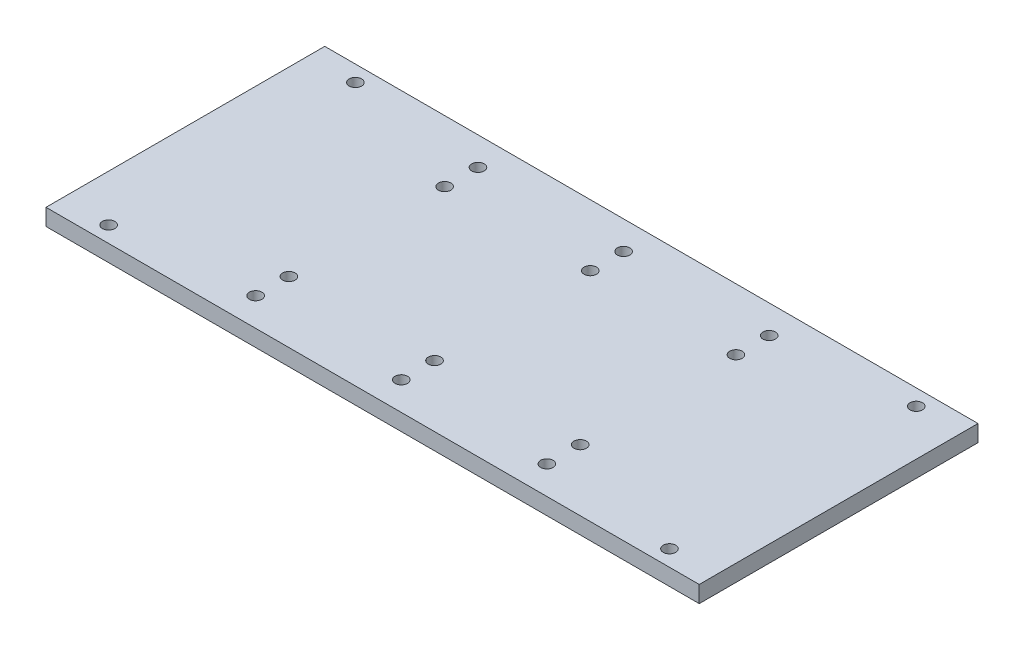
ISO-10303-21;
HEADER;
FILE_DESCRIPTION(('STEP AP214'),'2;1');
FILE_NAME('part.step','',(''),(''),'','','');
FILE_SCHEMA(('AUTOMOTIVE_DESIGN { 1 0 10303 214 1 1 1 1 }'));
ENDSEC;
DATA;
#1=APPLICATION_CONTEXT('core data for automotive mechanical design processes');
#2=APPLICATION_PROTOCOL_DEFINITION('international standard','automotive_design',2000,#1);
#3=PRODUCT_CONTEXT('',#1,'mechanical');
#4=PRODUCT('Part','Part','',(#3));
#5=PRODUCT_RELATED_PRODUCT_CATEGORY('part','',(#4));
#6=PRODUCT_DEFINITION_FORMATION('','',#4);
#7=PRODUCT_DEFINITION_CONTEXT('part definition',#1,'design');
#8=PRODUCT_DEFINITION('design','',#6,#7);
#9=PRODUCT_DEFINITION_SHAPE('','',#8);
#10=(LENGTH_UNIT() NAMED_UNIT(*) SI_UNIT(.MILLI.,.METRE.));
#11=(NAMED_UNIT(*) PLANE_ANGLE_UNIT() SI_UNIT($,.RADIAN.));
#12=(NAMED_UNIT(*) SI_UNIT($,.STERADIAN.) SOLID_ANGLE_UNIT());
#13=UNCERTAINTY_MEASURE_WITH_UNIT(LENGTH_MEASURE(1.E-05),#10,'distance_accuracy_value','');
#14=(GEOMETRIC_REPRESENTATION_CONTEXT(3) GLOBAL_UNCERTAINTY_ASSIGNED_CONTEXT((#13)) GLOBAL_UNIT_ASSIGNED_CONTEXT((#10,
#11,#12)) REPRESENTATION_CONTEXT('',''));
#15=CARTESIAN_POINT('',(0.,0.,0.));
#16=DIRECTION('',(0.,0.,1.));
#17=DIRECTION('',(1.,0.,0.));
#18=AXIS2_PLACEMENT_3D('',#15,#16,#17);
#19=CARTESIAN_POINT('',(78.5,4.,33.5));
#20=DIRECTION('',(-1.,0.,0.));
#21=DIRECTION('',(0.,0.,1.));
#22=AXIS2_PLACEMENT_3D('',#19,#20,#21);
#23=PLANE('',#22);
#24=DIRECTION('',(0.,0.,-1.));
#25=VECTOR('',#24,1.);
#26=CARTESIAN_POINT('',(78.5,0.,33.5));
#27=LINE('',#26,#25);
#28=CARTESIAN_POINT('',(78.5,0.,33.5));
#29=VERTEX_POINT('',#28);
#30=CARTESIAN_POINT('',(78.5,0.,-33.5));
#31=VERTEX_POINT('',#30);
#32=EDGE_CURVE('E100',#29,#31,#27,.T.);
#33=ORIENTED_EDGE('',*,*,#32,.T.);
#34=DIRECTION('',(0.,-1.,0.));
#35=VECTOR('',#34,1.);
#36=CARTESIAN_POINT('',(78.5,4.,-33.5));
#37=LINE('',#36,#35);
#38=CARTESIAN_POINT('',(78.5,4.,-33.5));
#39=VERTEX_POINT('',#38);
#40=EDGE_CURVE('E11',#39,#31,#37,.T.);
#41=ORIENTED_EDGE('',*,*,#40,.F.);
#42=DIRECTION('',(0.,0.,-1.));
#43=VECTOR('',#42,1.);
#44=CARTESIAN_POINT('',(78.5,4.,33.5));
#45=LINE('',#44,#43);
#46=CARTESIAN_POINT('',(78.5,4.,33.5));
#47=VERTEX_POINT('',#46);
#48=EDGE_CURVE('E87',#47,#39,#45,.T.);
#49=ORIENTED_EDGE('',*,*,#48,.F.);
#50=DIRECTION('',(0.,-1.,0.));
#51=VECTOR('',#50,1.);
#52=CARTESIAN_POINT('',(78.5,4.,33.5));
#53=LINE('',#52,#51);
#54=EDGE_CURVE('E96',#47,#29,#53,.T.);
#55=ORIENTED_EDGE('',*,*,#54,.T.);
#56=EDGE_LOOP('',(#33,#41,#49,#55));
#57=FACE_BOUND('',#56,.T.);
#58=ADVANCED_FACE('F34',(#57),#23,.F.);
#59=CARTESIAN_POINT('',(-78.5,4.,-33.5));
#60=DIRECTION('',(0.,0.,1.));
#61=DIRECTION('',(1.,0.,0.));
#62=AXIS2_PLACEMENT_3D('',#59,#60,#61);
#63=PLANE('',#62);
#64=DIRECTION('',(-1.,0.,0.));
#65=VECTOR('',#64,1.);
#66=CARTESIAN_POINT('',(-78.5,0.,-33.5));
#67=LINE('',#66,#65);
#68=CARTESIAN_POINT('',(-78.5,0.,-33.5));
#69=VERTEX_POINT('',#68);
#70=EDGE_CURVE('E91',#31,#69,#67,.T.);
#71=ORIENTED_EDGE('',*,*,#70,.T.);
#72=DIRECTION('',(0.,-1.,0.));
#73=VECTOR('',#72,1.);
#74=CARTESIAN_POINT('',(-78.5,4.,-33.5));
#75=LINE('',#74,#73);
#76=CARTESIAN_POINT('',(-78.5,4.,-33.5));
#77=VERTEX_POINT('',#76);
#78=EDGE_CURVE('E43',#77,#69,#75,.T.);
#79=ORIENTED_EDGE('',*,*,#78,.F.);
#80=DIRECTION('',(-1.,0.,0.));
#81=VECTOR('',#80,1.);
#82=CARTESIAN_POINT('',(-78.5,4.,-33.5));
#83=LINE('',#82,#81);
#84=EDGE_CURVE('E82',#39,#77,#83,.T.);
#85=ORIENTED_EDGE('',*,*,#84,.F.);
#86=ORIENTED_EDGE('',*,*,#40,.T.);
#87=EDGE_LOOP('',(#71,#79,#85,#86));
#88=FACE_BOUND('',#87,.T.);
#89=ADVANCED_FACE('F90',(#88),#63,.F.);
#90=CARTESIAN_POINT('',(-78.5,4.,33.5));
#91=DIRECTION('',(1.,0.,0.));
#92=DIRECTION('',(0.,0.,-1.));
#93=AXIS2_PLACEMENT_3D('',#90,#91,#92);
#94=PLANE('',#93);
#95=DIRECTION('',(0.,0.,1.));
#96=VECTOR('',#95,1.);
#97=CARTESIAN_POINT('',(-78.5,0.,33.5));
#98=LINE('',#97,#96);
#99=CARTESIAN_POINT('',(-78.5,0.,33.5));
#100=VERTEX_POINT('',#99);
#101=EDGE_CURVE('E69',#69,#100,#98,.T.);
#102=ORIENTED_EDGE('',*,*,#101,.T.);
#103=DIRECTION('',(0.,-1.,0.));
#104=VECTOR('',#103,1.);
#105=CARTESIAN_POINT('',(-78.5,4.,33.5));
#106=LINE('',#105,#104);
#107=CARTESIAN_POINT('',(-78.5,4.,33.5));
#108=VERTEX_POINT('',#107);
#109=EDGE_CURVE('E92',#108,#100,#106,.T.);
#110=ORIENTED_EDGE('',*,*,#109,.F.);
#111=DIRECTION('',(0.,0.,1.));
#112=VECTOR('',#111,1.);
#113=CARTESIAN_POINT('',(-78.5,4.,33.5));
#114=LINE('',#113,#112);
#115=EDGE_CURVE('E85',#77,#108,#114,.T.);
#116=ORIENTED_EDGE('',*,*,#115,.F.);
#117=ORIENTED_EDGE('',*,*,#78,.T.);
#118=EDGE_LOOP('',(#102,#110,#116,#117));
#119=FACE_BOUND('',#118,.T.);
#120=ADVANCED_FACE('F94',(#119),#94,.F.);
#121=CARTESIAN_POINT('',(-78.5,4.,33.5));
#122=DIRECTION('',(0.,0.,-1.));
#123=DIRECTION('',(-1.,0.,0.));
#124=AXIS2_PLACEMENT_3D('',#121,#122,#123);
#125=PLANE('',#124);
#126=DIRECTION('',(1.,0.,0.));
#127=VECTOR('',#126,1.);
#128=CARTESIAN_POINT('',(-78.5,0.,33.5));
#129=LINE('',#128,#127);
#130=EDGE_CURVE('E75',#100,#29,#129,.T.);
#131=ORIENTED_EDGE('',*,*,#130,.T.);
#132=ORIENTED_EDGE('',*,*,#54,.F.);
#133=DIRECTION('',(1.,0.,0.));
#134=VECTOR('',#133,1.);
#135=CARTESIAN_POINT('',(-78.5,4.,33.5));
#136=LINE('',#135,#134);
#137=EDGE_CURVE('E52',#108,#47,#136,.T.);
#138=ORIENTED_EDGE('',*,*,#137,.F.);
#139=ORIENTED_EDGE('',*,*,#109,.T.);
#140=EDGE_LOOP('',(#131,#132,#138,#139));
#141=FACE_BOUND('',#140,.T.);
#142=ADVANCED_FACE('F222',(#141),#125,.F.);
#143=CARTESIAN_POINT('',(0.,4.,0.));
#144=DIRECTION('',(0.,-1.,0.));
#145=DIRECTION('',(0.,0.,-1.));
#146=AXIS2_PLACEMENT_3D('',#143,#144,#145);
#147=PLANE('',#146);
#148=CARTESIAN_POINT('',(0.10111855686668,4.,-18.7153903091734));
#149=DIRECTION('',(0.,1.,0.));
#150=DIRECTION('',(0.,0.,1.));
#151=AXIS2_PLACEMENT_3D('',#148,#149,#150);
#152=CIRCLE('',#151,1.5);
#153=CARTESIAN_POINT('',(0.10111855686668,4.,-17.2153903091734));
#154=VERTEX_POINT('',#153);
#155=EDGE_CURVE('E147',#154,#154,#152,.T.);
#156=ORIENTED_EDGE('',*,*,#155,.F.);
#157=EDGE_LOOP('',(#156));
#158=FACE_BOUND('',#157,.T.);
#159=CARTESIAN_POINT('',(-34.8988814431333,4.,-18.7153903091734));
#160=DIRECTION('',(0.,1.,0.));
#161=DIRECTION('',(0.,0.,1.));
#162=AXIS2_PLACEMENT_3D('',#159,#160,#161);
#163=CIRCLE('',#162,1.5);
#164=CARTESIAN_POINT('',(-34.8988814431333,4.,-17.2153903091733));
#165=VERTEX_POINT('',#164);
#166=EDGE_CURVE('E410',#165,#165,#163,.T.);
#167=ORIENTED_EDGE('',*,*,#166,.F.);
#168=EDGE_LOOP('',(#167));
#169=FACE_BOUND('',#168,.T.);
#170=CARTESIAN_POINT('',(35.1011185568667,4.,-26.7153903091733));
#171=DIRECTION('',(0.,1.,0.));
#172=DIRECTION('',(0.,0.,1.));
#173=AXIS2_PLACEMENT_3D('',#170,#171,#172);
#174=CIRCLE('',#173,1.5);
#175=CARTESIAN_POINT('',(35.1011185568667,4.,-25.2153903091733));
#176=VERTEX_POINT('',#175);
#177=EDGE_CURVE('E413',#176,#176,#174,.T.);
#178=ORIENTED_EDGE('',*,*,#177,.F.);
#179=EDGE_LOOP('',(#178));
#180=FACE_BOUND('',#179,.T.);
#181=CARTESIAN_POINT('',(0.101118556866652,4.,-26.7153903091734));
#182=DIRECTION('',(0.,1.,0.));
#183=DIRECTION('',(0.,0.,1.));
#184=AXIS2_PLACEMENT_3D('',#181,#182,#183);
#185=CIRCLE('',#184,1.5);
#186=CARTESIAN_POINT('',(0.101118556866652,4.,-25.2153903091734));
#187=VERTEX_POINT('',#186);
#188=EDGE_CURVE('E417',#187,#187,#185,.T.);
#189=ORIENTED_EDGE('',*,*,#188,.F.);
#190=EDGE_LOOP('',(#189));
#191=FACE_BOUND('',#190,.T.);
#192=CARTESIAN_POINT('',(-34.8988814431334,4.,-26.7153903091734));
#193=DIRECTION('',(0.,1.,0.));
#194=DIRECTION('',(0.,0.,1.));
#195=AXIS2_PLACEMENT_3D('',#192,#193,#194);
#196=CIRCLE('',#195,1.5);
#197=CARTESIAN_POINT('',(-34.8988814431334,4.,-25.2153903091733));
#198=VERTEX_POINT('',#197);
#199=EDGE_CURVE('E165',#198,#198,#196,.T.);
#200=ORIENTED_EDGE('',*,*,#199,.F.);
#201=EDGE_LOOP('',(#200));
#202=FACE_BOUND('',#201,.T.);
#203=CARTESIAN_POINT('',(35.1011185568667,4.,-18.7153903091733));
#204=DIRECTION('',(0.,1.,0.));
#205=DIRECTION('',(0.,0.,1.));
#206=AXIS2_PLACEMENT_3D('',#203,#204,#205);
#207=CIRCLE('',#206,1.5);
#208=CARTESIAN_POINT('',(35.1011185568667,4.,-17.2153903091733));
#209=VERTEX_POINT('',#208);
#210=EDGE_CURVE('E142',#209,#209,#207,.T.);
#211=ORIENTED_EDGE('',*,*,#210,.F.);
#212=EDGE_LOOP('',(#211));
#213=FACE_BOUND('',#212,.T.);
#214=CARTESIAN_POINT('',(0.101118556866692,3.99999999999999,18.7153903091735));
#215=DIRECTION('',(0.,1.,0.));
#216=DIRECTION('',(0.,0.,1.));
#217=AXIS2_PLACEMENT_3D('',#214,#215,#216);
#218=CIRCLE('',#217,1.5);
#219=CARTESIAN_POINT('',(0.101118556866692,3.99999999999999,20.2153903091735));
#220=VERTEX_POINT('',#219);
#221=EDGE_CURVE('E126',#220,#220,#218,.T.);
#222=ORIENTED_EDGE('',*,*,#221,.F.);
#223=EDGE_LOOP('',(#222));
#224=FACE_BOUND('',#223,.T.);
#225=CARTESIAN_POINT('',(35.1011185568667,3.99999999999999,18.7153903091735));
#226=DIRECTION('',(0.,1.,0.));
#227=DIRECTION('',(0.,0.,1.));
#228=AXIS2_PLACEMENT_3D('',#225,#226,#227);
#229=CIRCLE('',#228,1.5);
#230=CARTESIAN_POINT('',(35.1011185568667,3.99999999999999,20.2153903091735));
#231=VERTEX_POINT('',#230);
#232=EDGE_CURVE('E169',#231,#231,#229,.T.);
#233=ORIENTED_EDGE('',*,*,#232,.F.);
#234=EDGE_LOOP('',(#233));
#235=FACE_BOUND('',#234,.T.);
#236=CARTESIAN_POINT('',(-34.8988814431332,3.99999999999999,26.7153903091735));
#237=DIRECTION('',(0.,1.,0.));
#238=DIRECTION('',(0.,0.,1.));
#239=AXIS2_PLACEMENT_3D('',#236,#237,#238);
#240=CIRCLE('',#239,1.5);
#241=CARTESIAN_POINT('',(-34.8988814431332,3.99999999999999,28.2153903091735));
#242=VERTEX_POINT('',#241);
#243=EDGE_CURVE('E172',#242,#242,#240,.T.);
#244=ORIENTED_EDGE('',*,*,#243,.F.);
#245=EDGE_LOOP('',(#244));
#246=FACE_BOUND('',#245,.T.);
#247=CARTESIAN_POINT('',(0.101118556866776,3.99999999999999,26.7153903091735));
#248=DIRECTION('',(0.,1.,0.));
#249=DIRECTION('',(0.,0.,1.));
#250=AXIS2_PLACEMENT_3D('',#247,#248,#249);
#251=CIRCLE('',#250,1.5);
#252=CARTESIAN_POINT('',(0.101118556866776,3.99999999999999,28.2153903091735));
#253=VERTEX_POINT('',#252);
#254=EDGE_CURVE('E175',#253,#253,#251,.T.);
#255=ORIENTED_EDGE('',*,*,#254,.F.);
#256=EDGE_LOOP('',(#255));
#257=FACE_BOUND('',#256,.T.);
#258=CARTESIAN_POINT('',(35.1011185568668,3.99999999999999,26.7153903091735));
#259=DIRECTION('',(0.,1.,0.));
#260=DIRECTION('',(0.,0.,1.));
#261=AXIS2_PLACEMENT_3D('',#258,#259,#260);
#262=CIRCLE('',#261,1.5);
#263=CARTESIAN_POINT('',(35.1011185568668,3.99999999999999,28.2153903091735));
#264=VERTEX_POINT('',#263);
#265=EDGE_CURVE('E141',#264,#264,#262,.T.);
#266=ORIENTED_EDGE('',*,*,#265,.F.);
#267=EDGE_LOOP('',(#266));
#268=FACE_BOUND('',#267,.T.);
#269=CARTESIAN_POINT('',(-34.8988814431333,3.99999999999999,18.7153903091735));
#270=DIRECTION('',(0.,1.,0.));
#271=DIRECTION('',(0.,0.,1.));
#272=AXIS2_PLACEMENT_3D('',#269,#270,#271);
#273=CIRCLE('',#272,1.5);
#274=CARTESIAN_POINT('',(-34.8988814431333,3.99999999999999,20.2153903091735));
#275=VERTEX_POINT('',#274);
#276=EDGE_CURVE('E121',#275,#275,#273,.T.);
#277=ORIENTED_EDGE('',*,*,#276,.F.);
#278=EDGE_LOOP('',(#277));
#279=FACE_BOUND('',#278,.T.);
#280=CARTESIAN_POINT('',(-67.2977628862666,4.,29.6576766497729));
#281=DIRECTION('',(0.,-1.,0.));
#282=DIRECTION('',(0.,0.,-1.));
#283=AXIS2_PLACEMENT_3D('',#280,#281,#282);
#284=CIRCLE('',#283,1.50000000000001);
#285=CARTESIAN_POINT('',(-67.2977628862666,4.,28.1576766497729));
#286=VERTEX_POINT('',#285);
#287=EDGE_CURVE('E184',#286,#286,#284,.T.);
#288=ORIENTED_EDGE('',*,*,#287,.T.);
#289=EDGE_LOOP('',(#288));
#290=FACE_BOUND('',#289,.T.);
#291=CARTESIAN_POINT('',(67.5,4.,29.657676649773));
#292=DIRECTION('',(0.,-1.,0.));
#293=DIRECTION('',(0.,0.,-1.));
#294=AXIS2_PLACEMENT_3D('',#291,#292,#293);
#295=CIRCLE('',#294,1.49999999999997);
#296=CARTESIAN_POINT('',(67.5,4.,28.157676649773));
#297=VERTEX_POINT('',#296);
#298=EDGE_CURVE('E116',#297,#297,#295,.T.);
#299=ORIENTED_EDGE('',*,*,#298,.T.);
#300=EDGE_LOOP('',(#299));
#301=FACE_BOUND('',#300,.T.);
#302=CARTESIAN_POINT('',(-67.2977628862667,4.,-29.6576766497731));
#303=DIRECTION('',(0.,-1.,0.));
#304=DIRECTION('',(0.,0.,-1.));
#305=AXIS2_PLACEMENT_3D('',#302,#303,#304);
#306=CIRCLE('',#305,1.5);
#307=CARTESIAN_POINT('',(-67.2977628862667,4.,-31.1576766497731));
#308=VERTEX_POINT('',#307);
#309=EDGE_CURVE('E112',#308,#308,#306,.T.);
#310=ORIENTED_EDGE('',*,*,#309,.T.);
#311=EDGE_LOOP('',(#310));
#312=FACE_BOUND('',#311,.T.);
#313=CARTESIAN_POINT('',(67.5,4.,-29.6576766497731));
#314=DIRECTION('',(0.,-1.,0.));
#315=DIRECTION('',(0.,0.,-1.));
#316=AXIS2_PLACEMENT_3D('',#313,#314,#315);
#317=CIRCLE('',#316,1.5);
#318=CARTESIAN_POINT('',(67.5,4.,-31.1576766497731));
#319=VERTEX_POINT('',#318);
#320=EDGE_CURVE('E103',#319,#319,#317,.T.);
#321=ORIENTED_EDGE('',*,*,#320,.T.);
#322=EDGE_LOOP('',(#321));
#323=FACE_BOUND('',#322,.T.);
#324=ORIENTED_EDGE('',*,*,#48,.T.);
#325=ORIENTED_EDGE('',*,*,#84,.T.);
#326=ORIENTED_EDGE('',*,*,#115,.T.);
#327=ORIENTED_EDGE('',*,*,#137,.T.);
#328=EDGE_LOOP('',(#324,#325,#326,#327));
#329=FACE_BOUND('',#328,.T.);
#330=ADVANCED_FACE('F83',(#158,#169,#180,#191,#202,#213,#224,#235,#246,#257,#268,#279,#290,#301,
#312,#323,#329),#147,.F.);
#331=CARTESIAN_POINT('',(0.,0.,0.));
#332=DIRECTION('',(0.,-1.,0.));
#333=DIRECTION('',(0.,0.,-1.));
#334=AXIS2_PLACEMENT_3D('',#331,#332,#333);
#335=PLANE('',#334);
#336=CARTESIAN_POINT('',(0.10111855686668,0.,-18.7153903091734));
#337=DIRECTION('',(0.,-1.,0.));
#338=DIRECTION('',(0.,0.,-1.));
#339=AXIS2_PLACEMENT_3D('',#336,#337,#338);
#340=CIRCLE('',#339,1.5);
#341=CARTESIAN_POINT('',(0.10111855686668,0.,-20.2153903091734));
#342=VERTEX_POINT('',#341);
#343=EDGE_CURVE('E37',#342,#342,#340,.T.);
#344=ORIENTED_EDGE('',*,*,#343,.F.);
#345=EDGE_LOOP('',(#344));
#346=FACE_BOUND('',#345,.T.);
#347=CARTESIAN_POINT('',(-34.8988814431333,0.,-18.7153903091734));
#348=DIRECTION('',(0.,-1.,0.));
#349=DIRECTION('',(0.,0.,-1.));
#350=AXIS2_PLACEMENT_3D('',#347,#348,#349);
#351=CIRCLE('',#350,1.5);
#352=CARTESIAN_POINT('',(-34.8988814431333,0.,-20.2153903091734));
#353=VERTEX_POINT('',#352);
#354=EDGE_CURVE('E152',#353,#353,#351,.T.);
#355=ORIENTED_EDGE('',*,*,#354,.F.);
#356=EDGE_LOOP('',(#355));
#357=FACE_BOUND('',#356,.T.);
#358=CARTESIAN_POINT('',(35.1011185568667,0.,-26.7153903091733));
#359=DIRECTION('',(0.,-1.,0.));
#360=DIRECTION('',(0.,0.,-1.));
#361=AXIS2_PLACEMENT_3D('',#358,#359,#360);
#362=CIRCLE('',#361,1.5);
#363=CARTESIAN_POINT('',(35.1011185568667,0.,-28.2153903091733));
#364=VERTEX_POINT('',#363);
#365=EDGE_CURVE('E150',#364,#364,#362,.T.);
#366=ORIENTED_EDGE('',*,*,#365,.F.);
#367=EDGE_LOOP('',(#366));
#368=FACE_BOUND('',#367,.T.);
#369=CARTESIAN_POINT('',(0.101118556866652,0.,-26.7153903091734));
#370=DIRECTION('',(0.,-1.,0.));
#371=DIRECTION('',(0.,0.,-1.));
#372=AXIS2_PLACEMENT_3D('',#369,#370,#371);
#373=CIRCLE('',#372,1.5);
#374=CARTESIAN_POINT('',(0.101118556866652,0.,-28.2153903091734));
#375=VERTEX_POINT('',#374);
#376=EDGE_CURVE('E146',#375,#375,#373,.T.);
#377=ORIENTED_EDGE('',*,*,#376,.F.);
#378=EDGE_LOOP('',(#377));
#379=FACE_BOUND('',#378,.T.);
#380=CARTESIAN_POINT('',(-34.8988814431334,0.,-26.7153903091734));
#381=DIRECTION('',(0.,-1.,0.));
#382=DIRECTION('',(0.,0.,-1.));
#383=AXIS2_PLACEMENT_3D('',#380,#381,#382);
#384=CIRCLE('',#383,1.5);
#385=CARTESIAN_POINT('',(-34.8988814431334,0.,-28.2153903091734));
#386=VERTEX_POINT('',#385);
#387=EDGE_CURVE('E143',#386,#386,#384,.T.);
#388=ORIENTED_EDGE('',*,*,#387,.F.);
#389=EDGE_LOOP('',(#388));
#390=FACE_BOUND('',#389,.T.);
#391=CARTESIAN_POINT('',(35.1011185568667,0.,-18.7153903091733));
#392=DIRECTION('',(0.,-1.,0.));
#393=DIRECTION('',(0.,0.,-1.));
#394=AXIS2_PLACEMENT_3D('',#391,#392,#393);
#395=CIRCLE('',#394,1.5);
#396=CARTESIAN_POINT('',(35.1011185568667,0.,-20.2153903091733));
#397=VERTEX_POINT('',#396);
#398=EDGE_CURVE('E138',#397,#397,#395,.T.);
#399=ORIENTED_EDGE('',*,*,#398,.F.);
#400=EDGE_LOOP('',(#399));
#401=FACE_BOUND('',#400,.T.);
#402=CARTESIAN_POINT('',(0.101118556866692,0.,18.7153903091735));
#403=DIRECTION('',(0.,-1.,0.));
#404=DIRECTION('',(0.,0.,-1.));
#405=AXIS2_PLACEMENT_3D('',#402,#403,#404);
#406=CIRCLE('',#405,1.5);
#407=CARTESIAN_POINT('',(0.101118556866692,0.,17.2153903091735));
#408=VERTEX_POINT('',#407);
#409=EDGE_CURVE('E135',#408,#408,#406,.T.);
#410=ORIENTED_EDGE('',*,*,#409,.F.);
#411=EDGE_LOOP('',(#410));
#412=FACE_BOUND('',#411,.T.);
#413=CARTESIAN_POINT('',(35.1011185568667,0.,18.7153903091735));
#414=DIRECTION('',(0.,-1.,0.));
#415=DIRECTION('',(0.,0.,-1.));
#416=AXIS2_PLACEMENT_3D('',#413,#414,#415);
#417=CIRCLE('',#416,1.5);
#418=CARTESIAN_POINT('',(35.1011185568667,0.,17.2153903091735));
#419=VERTEX_POINT('',#418);
#420=EDGE_CURVE('E132',#419,#419,#417,.T.);
#421=ORIENTED_EDGE('',*,*,#420,.F.);
#422=EDGE_LOOP('',(#421));
#423=FACE_BOUND('',#422,.T.);
#424=CARTESIAN_POINT('',(-34.8988814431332,0.,26.7153903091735));
#425=DIRECTION('',(0.,-1.,0.));
#426=DIRECTION('',(0.,0.,-1.));
#427=AXIS2_PLACEMENT_3D('',#424,#425,#426);
#428=CIRCLE('',#427,1.5);
#429=CARTESIAN_POINT('',(-34.8988814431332,0.,25.2153903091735));
#430=VERTEX_POINT('',#429);
#431=EDGE_CURVE('E129',#430,#430,#428,.T.);
#432=ORIENTED_EDGE('',*,*,#431,.F.);
#433=EDGE_LOOP('',(#432));
#434=FACE_BOUND('',#433,.T.);
#435=CARTESIAN_POINT('',(0.101118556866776,0.,26.7153903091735));
#436=DIRECTION('',(0.,-1.,0.));
#437=DIRECTION('',(0.,0.,-1.));
#438=AXIS2_PLACEMENT_3D('',#435,#436,#437);
#439=CIRCLE('',#438,1.5);
#440=CARTESIAN_POINT('',(0.101118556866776,0.,25.2153903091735));
#441=VERTEX_POINT('',#440);
#442=EDGE_CURVE('E125',#441,#441,#439,.T.);
#443=ORIENTED_EDGE('',*,*,#442,.F.);
#444=EDGE_LOOP('',(#443));
#445=FACE_BOUND('',#444,.T.);
#446=CARTESIAN_POINT('',(35.1011185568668,0.,26.7153903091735));
#447=DIRECTION('',(0.,-1.,0.));
#448=DIRECTION('',(0.,0.,-1.));
#449=AXIS2_PLACEMENT_3D('',#446,#447,#448);
#450=CIRCLE('',#449,1.5);
#451=CARTESIAN_POINT('',(35.1011185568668,0.,25.2153903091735));
#452=VERTEX_POINT('',#451);
#453=EDGE_CURVE('E122',#452,#452,#450,.T.);
#454=ORIENTED_EDGE('',*,*,#453,.F.);
#455=EDGE_LOOP('',(#454));
#456=FACE_BOUND('',#455,.T.);
#457=CARTESIAN_POINT('',(-34.8988814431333,0.,18.7153903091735));
#458=DIRECTION('',(0.,-1.,0.));
#459=DIRECTION('',(0.,0.,-1.));
#460=AXIS2_PLACEMENT_3D('',#457,#458,#459);
#461=CIRCLE('',#460,1.5);
#462=CARTESIAN_POINT('',(-34.8988814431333,0.,17.2153903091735));
#463=VERTEX_POINT('',#462);
#464=EDGE_CURVE('E117',#463,#463,#461,.T.);
#465=ORIENTED_EDGE('',*,*,#464,.F.);
#466=EDGE_LOOP('',(#465));
#467=FACE_BOUND('',#466,.T.);
#468=CARTESIAN_POINT('',(-67.2977628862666,0.,29.6576766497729));
#469=DIRECTION('',(0.,-1.,0.));
#470=DIRECTION('',(0.,0.,-1.));
#471=AXIS2_PLACEMENT_3D('',#468,#469,#470);
#472=CIRCLE('',#471,1.50000000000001);
#473=CARTESIAN_POINT('',(-67.2977628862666,0.,28.1576766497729));
#474=VERTEX_POINT('',#473);
#475=EDGE_CURVE('E120',#474,#474,#472,.T.);
#476=ORIENTED_EDGE('',*,*,#475,.F.);
#477=EDGE_LOOP('',(#476));
#478=FACE_BOUND('',#477,.T.);
#479=CARTESIAN_POINT('',(67.5,0.,29.657676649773));
#480=DIRECTION('',(0.,-1.,0.));
#481=DIRECTION('',(0.,0.,-1.));
#482=AXIS2_PLACEMENT_3D('',#479,#480,#481);
#483=CIRCLE('',#482,1.49999999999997);
#484=CARTESIAN_POINT('',(67.5,0.,28.157676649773));
#485=VERTEX_POINT('',#484);
#486=EDGE_CURVE('E187',#485,#485,#483,.T.);
#487=ORIENTED_EDGE('',*,*,#486,.F.);
#488=EDGE_LOOP('',(#487));
#489=FACE_BOUND('',#488,.T.);
#490=CARTESIAN_POINT('',(-67.2977628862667,0.,-29.6576766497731));
#491=DIRECTION('',(0.,-1.,0.));
#492=DIRECTION('',(0.,0.,-1.));
#493=AXIS2_PLACEMENT_3D('',#490,#491,#492);
#494=CIRCLE('',#493,1.5);
#495=CARTESIAN_POINT('',(-67.2977628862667,0.,-31.1576766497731));
#496=VERTEX_POINT('',#495);
#497=EDGE_CURVE('E113',#496,#496,#494,.T.);
#498=ORIENTED_EDGE('',*,*,#497,.F.);
#499=EDGE_LOOP('',(#498));
#500=FACE_BOUND('',#499,.T.);
#501=CARTESIAN_POINT('',(67.5,0.,-29.6576766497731));
#502=DIRECTION('',(0.,-1.,0.));
#503=DIRECTION('',(0.,0.,-1.));
#504=AXIS2_PLACEMENT_3D('',#501,#502,#503);
#505=CIRCLE('',#504,1.5);
#506=CARTESIAN_POINT('',(67.5,0.,-31.1576766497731));
#507=VERTEX_POINT('',#506);
#508=EDGE_CURVE('E109',#507,#507,#505,.T.);
#509=ORIENTED_EDGE('',*,*,#508,.F.);
#510=EDGE_LOOP('',(#509));
#511=FACE_BOUND('',#510,.T.);
#512=ORIENTED_EDGE('',*,*,#32,.F.);
#513=ORIENTED_EDGE('',*,*,#130,.F.);
#514=ORIENTED_EDGE('',*,*,#101,.F.);
#515=ORIENTED_EDGE('',*,*,#70,.F.);
#516=EDGE_LOOP('',(#512,#513,#514,#515));
#517=FACE_BOUND('',#516,.T.);
#518=ADVANCED_FACE('F201',(#346,#357,#368,#379,#390,#401,#412,#423,#434,#445,#456,#467,#478,
#489,#500,#511,#517),#335,.T.);
#519=CARTESIAN_POINT('',(67.5,17.,-29.657676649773));
#520=DIRECTION('',(0.,-1.,0.));
#521=DIRECTION('',(0.,0.,-1.));
#522=AXIS2_PLACEMENT_3D('',#519,#520,#521);
#523=CYLINDRICAL_SURFACE('',#522,1.5);
#524=ORIENTED_EDGE('',*,*,#508,.T.);
#525=EDGE_LOOP('',(#524));
#526=FACE_BOUND('',#525,.T.);
#527=ORIENTED_EDGE('',*,*,#320,.F.);
#528=EDGE_LOOP('',(#527));
#529=FACE_BOUND('',#528,.T.);
#530=ADVANCED_FACE('F198',(#526,#529),#523,.F.);
#531=CARTESIAN_POINT('',(-67.2977628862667,17.,-29.657676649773));
#532=DIRECTION('',(0.,-1.,0.));
#533=DIRECTION('',(0.,0.,-1.));
#534=AXIS2_PLACEMENT_3D('',#531,#532,#533);
#535=CYLINDRICAL_SURFACE('',#534,1.5);
#536=ORIENTED_EDGE('',*,*,#497,.T.);
#537=EDGE_LOOP('',(#536));
#538=FACE_BOUND('',#537,.T.);
#539=ORIENTED_EDGE('',*,*,#309,.F.);
#540=EDGE_LOOP('',(#539));
#541=FACE_BOUND('',#540,.T.);
#542=ADVANCED_FACE('F200',(#538,#541),#535,.F.);
#543=CARTESIAN_POINT('',(67.5,20.,29.657676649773));
#544=DIRECTION('',(0.,-1.,0.));
#545=DIRECTION('',(0.,0.,-1.));
#546=AXIS2_PLACEMENT_3D('',#543,#544,#545);
#547=CYLINDRICAL_SURFACE('',#546,1.49999999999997);
#548=ORIENTED_EDGE('',*,*,#486,.T.);
#549=EDGE_LOOP('',(#548));
#550=FACE_BOUND('',#549,.T.);
#551=ORIENTED_EDGE('',*,*,#298,.F.);
#552=EDGE_LOOP('',(#551));
#553=FACE_BOUND('',#552,.T.);
#554=ADVANCED_FACE('F208',(#550,#553),#547,.F.);
#555=CARTESIAN_POINT('',(-67.2977628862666,20.,29.6576766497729));
#556=DIRECTION('',(0.,-1.,0.));
#557=DIRECTION('',(0.,0.,-1.));
#558=AXIS2_PLACEMENT_3D('',#555,#556,#557);
#559=CYLINDRICAL_SURFACE('',#558,1.50000000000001);
#560=ORIENTED_EDGE('',*,*,#475,.T.);
#561=EDGE_LOOP('',(#560));
#562=FACE_BOUND('',#561,.T.);
#563=ORIENTED_EDGE('',*,*,#287,.F.);
#564=EDGE_LOOP('',(#563));
#565=FACE_BOUND('',#564,.T.);
#566=ADVANCED_FACE('F275',(#562,#565),#559,.F.);
#567=CARTESIAN_POINT('',(-34.8988814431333,-16.,18.7153903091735));
#568=DIRECTION('',(0.,1.,0.));
#569=DIRECTION('',(0.,0.,1.));
#570=AXIS2_PLACEMENT_3D('',#567,#568,#569);
#571=CYLINDRICAL_SURFACE('',#570,1.5);
#572=ORIENTED_EDGE('',*,*,#464,.T.);
#573=EDGE_LOOP('',(#572));
#574=FACE_BOUND('',#573,.T.);
#575=ORIENTED_EDGE('',*,*,#276,.T.);
#576=EDGE_LOOP('',(#575));
#577=FACE_BOUND('',#576,.T.);
#578=ADVANCED_FACE('F284',(#574,#577),#571,.F.);
#579=CARTESIAN_POINT('',(35.1011185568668,-16.,26.7153903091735));
#580=DIRECTION('',(0.,1.,0.));
#581=DIRECTION('',(0.,0.,1.));
#582=AXIS2_PLACEMENT_3D('',#579,#580,#581);
#583=CYLINDRICAL_SURFACE('',#582,1.5);
#584=ORIENTED_EDGE('',*,*,#453,.T.);
#585=EDGE_LOOP('',(#584));
#586=FACE_BOUND('',#585,.T.);
#587=ORIENTED_EDGE('',*,*,#265,.T.);
#588=EDGE_LOOP('',(#587));
#589=FACE_BOUND('',#588,.T.);
#590=ADVANCED_FACE('F293',(#586,#589),#583,.F.);
#591=CARTESIAN_POINT('',(0.101118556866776,-16.,26.7153903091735));
#592=DIRECTION('',(0.,1.,0.));
#593=DIRECTION('',(0.,0.,1.));
#594=AXIS2_PLACEMENT_3D('',#591,#592,#593);
#595=CYLINDRICAL_SURFACE('',#594,1.5);
#596=ORIENTED_EDGE('',*,*,#442,.T.);
#597=EDGE_LOOP('',(#596));
#598=FACE_BOUND('',#597,.T.);
#599=ORIENTED_EDGE('',*,*,#254,.T.);
#600=EDGE_LOOP('',(#599));
#601=FACE_BOUND('',#600,.T.);
#602=ADVANCED_FACE('F302',(#598,#601),#595,.F.);
#603=CARTESIAN_POINT('',(-34.8988814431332,-16.,26.7153903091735));
#604=DIRECTION('',(0.,1.,0.));
#605=DIRECTION('',(0.,0.,1.));
#606=AXIS2_PLACEMENT_3D('',#603,#604,#605);
#607=CYLINDRICAL_SURFACE('',#606,1.5);
#608=ORIENTED_EDGE('',*,*,#431,.T.);
#609=EDGE_LOOP('',(#608));
#610=FACE_BOUND('',#609,.T.);
#611=ORIENTED_EDGE('',*,*,#243,.T.);
#612=EDGE_LOOP('',(#611));
#613=FACE_BOUND('',#612,.T.);
#614=ADVANCED_FACE('F311',(#610,#613),#607,.F.);
#615=CARTESIAN_POINT('',(35.1011185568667,-16.,18.7153903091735));
#616=DIRECTION('',(0.,1.,0.));
#617=DIRECTION('',(0.,0.,1.));
#618=AXIS2_PLACEMENT_3D('',#615,#616,#617);
#619=CYLINDRICAL_SURFACE('',#618,1.5);
#620=ORIENTED_EDGE('',*,*,#420,.T.);
#621=EDGE_LOOP('',(#620));
#622=FACE_BOUND('',#621,.T.);
#623=ORIENTED_EDGE('',*,*,#232,.T.);
#624=EDGE_LOOP('',(#623));
#625=FACE_BOUND('',#624,.T.);
#626=ADVANCED_FACE('F320',(#622,#625),#619,.F.);
#627=CARTESIAN_POINT('',(0.101118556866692,-16.,18.7153903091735));
#628=DIRECTION('',(0.,1.,0.));
#629=DIRECTION('',(0.,0.,1.));
#630=AXIS2_PLACEMENT_3D('',#627,#628,#629);
#631=CYLINDRICAL_SURFACE('',#630,1.5);
#632=ORIENTED_EDGE('',*,*,#409,.T.);
#633=EDGE_LOOP('',(#632));
#634=FACE_BOUND('',#633,.T.);
#635=ORIENTED_EDGE('',*,*,#221,.T.);
#636=EDGE_LOOP('',(#635));
#637=FACE_BOUND('',#636,.T.);
#638=ADVANCED_FACE('F329',(#634,#637),#631,.F.);
#639=CARTESIAN_POINT('',(35.1011185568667,-16.,-18.7153903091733));
#640=DIRECTION('',(0.,1.,0.));
#641=DIRECTION('',(0.,0.,1.));
#642=AXIS2_PLACEMENT_3D('',#639,#640,#641);
#643=CYLINDRICAL_SURFACE('',#642,1.5);
#644=ORIENTED_EDGE('',*,*,#398,.T.);
#645=EDGE_LOOP('',(#644));
#646=FACE_BOUND('',#645,.T.);
#647=ORIENTED_EDGE('',*,*,#210,.T.);
#648=EDGE_LOOP('',(#647));
#649=FACE_BOUND('',#648,.T.);
#650=ADVANCED_FACE('F338',(#646,#649),#643,.F.);
#651=CARTESIAN_POINT('',(-34.8988814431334,-16.,-26.7153903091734));
#652=DIRECTION('',(0.,1.,0.));
#653=DIRECTION('',(0.,0.,1.));
#654=AXIS2_PLACEMENT_3D('',#651,#652,#653);
#655=CYLINDRICAL_SURFACE('',#654,1.5);
#656=ORIENTED_EDGE('',*,*,#387,.T.);
#657=EDGE_LOOP('',(#656));
#658=FACE_BOUND('',#657,.T.);
#659=ORIENTED_EDGE('',*,*,#199,.T.);
#660=EDGE_LOOP('',(#659));
#661=FACE_BOUND('',#660,.T.);
#662=ADVANCED_FACE('F347',(#658,#661),#655,.F.);
#663=CARTESIAN_POINT('',(0.101118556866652,-16.,-26.7153903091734));
#664=DIRECTION('',(0.,1.,0.));
#665=DIRECTION('',(0.,0.,1.));
#666=AXIS2_PLACEMENT_3D('',#663,#664,#665);
#667=CYLINDRICAL_SURFACE('',#666,1.5);
#668=ORIENTED_EDGE('',*,*,#376,.T.);
#669=EDGE_LOOP('',(#668));
#670=FACE_BOUND('',#669,.T.);
#671=ORIENTED_EDGE('',*,*,#188,.T.);
#672=EDGE_LOOP('',(#671));
#673=FACE_BOUND('',#672,.T.);
#674=ADVANCED_FACE('F356',(#670,#673),#667,.F.);
#675=CARTESIAN_POINT('',(35.1011185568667,-16.,-26.7153903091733));
#676=DIRECTION('',(0.,1.,0.));
#677=DIRECTION('',(0.,0.,1.));
#678=AXIS2_PLACEMENT_3D('',#675,#676,#677);
#679=CYLINDRICAL_SURFACE('',#678,1.5);
#680=ORIENTED_EDGE('',*,*,#365,.T.);
#681=EDGE_LOOP('',(#680));
#682=FACE_BOUND('',#681,.T.);
#683=ORIENTED_EDGE('',*,*,#177,.T.);
#684=EDGE_LOOP('',(#683));
#685=FACE_BOUND('',#684,.T.);
#686=ADVANCED_FACE('F365',(#682,#685),#679,.F.);
#687=CARTESIAN_POINT('',(-34.8988814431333,-16.,-18.7153903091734));
#688=DIRECTION('',(0.,1.,0.));
#689=DIRECTION('',(0.,0.,1.));
#690=AXIS2_PLACEMENT_3D('',#687,#688,#689);
#691=CYLINDRICAL_SURFACE('',#690,1.5);
#692=ORIENTED_EDGE('',*,*,#354,.T.);
#693=EDGE_LOOP('',(#692));
#694=FACE_BOUND('',#693,.T.);
#695=ORIENTED_EDGE('',*,*,#166,.T.);
#696=EDGE_LOOP('',(#695));
#697=FACE_BOUND('',#696,.T.);
#698=ADVANCED_FACE('F374',(#694,#697),#691,.F.);
#699=CARTESIAN_POINT('',(0.10111855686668,-16.,-18.7153903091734));
#700=DIRECTION('',(0.,1.,0.));
#701=DIRECTION('',(0.,0.,1.));
#702=AXIS2_PLACEMENT_3D('',#699,#700,#701);
#703=CYLINDRICAL_SURFACE('',#702,1.5);
#704=ORIENTED_EDGE('',*,*,#343,.T.);
#705=EDGE_LOOP('',(#704));
#706=FACE_BOUND('',#705,.T.);
#707=ORIENTED_EDGE('',*,*,#155,.T.);
#708=EDGE_LOOP('',(#707));
#709=FACE_BOUND('',#708,.T.);
#710=ADVANCED_FACE('F383',(#706,#709),#703,.F.);
#711=CLOSED_SHELL('',(#58,#89,#120,#142,#330,#518,#530,#542,#554,#566,#578,#590,#602,#614,#626,
#638,#650,#662,#674,#686,#698,#710));
#712=MANIFOLD_SOLID_BREP('B2',#711);
#713=ADVANCED_BREP_SHAPE_REPRESENTATION('',(#18,#712),#14);
#714=SHAPE_DEFINITION_REPRESENTATION(#9,#713);
ENDSEC;
END-ISO-10303-21;
